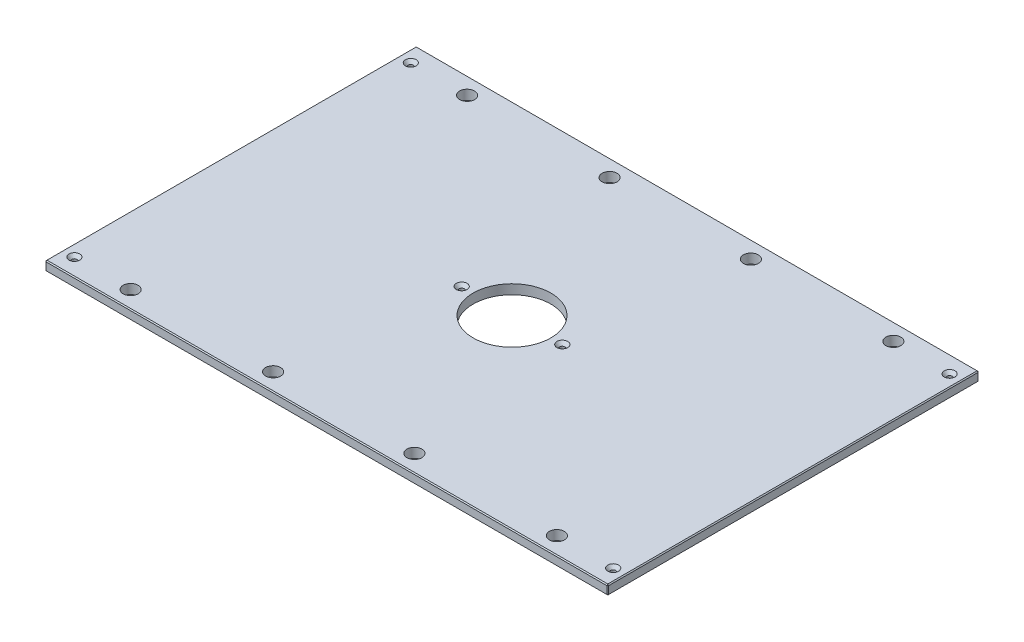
from build123d import *

# Parameters (mm, degrees)
SKETCH1_W                                        = 746.125
SKETCH1_H                                        = 492.125
BOSS_EXTRUDE1_DEPTH                              = 12.7
SKETCH13_R                                       = 51.562
CUT_EXTRUDE6_DEPTH                               = 448.083518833
F_25_32_0_78125_DIAMETER_HOLE1_D                 = 19.84375
CHAMFER2_SIZE                                    = 1.27
CSK_FOR_1_4_FLAT_HEAD_MACHINE_SCREW1_D           = 6.7564
CSK_FOR_1_4_FLAT_HEAD_MACHINE_SCREW1_CSINK_D     = 14.2748
CSK_FOR_1_4_FLAT_HEAD_MACHINE_SCREW1_CSINK_ANGLE = 82


with BuildPart() as part:
    # Sketch1 → Boss-Extrude1 (new body)
    with BuildSketch(Plane(origin=(0, 0, 0), x_dir=(1, 0, 0), z_dir=(0, 1, 0))):
        Rectangle(SKETCH1_W, SKETCH1_H)
    extrude(amount=BOSS_EXTRUDE1_DEPTH)

    # Sketch13 → Cut-Extrude6 (cut, through all)
    with BuildSketch(Plane(origin=(0, 12.7, 0), x_dir=(1, 0, 0), z_dir=(0, 1, 0))):
        with Locations(Location((0, 0, 0), (0, 0, 270))):
            Circle(SKETCH13_R)
    extrude(amount=-CUT_EXTRUDE6_DEPTH, mode=Mode.SUBTRACT)

    # 25_32 _0.78125_ Diameter Hole1 (through all)
    with Locations(Plane(origin=(0, 12.7, 0), x_dir=(1, 0, 0), z_dir=(0, 1, 0))):
        with Locations((282.575, 223.04248), (-282.575, 223.04248), (282.575, -223.04248), (-282.575, -223.04248), (-93.6625, 223.04248), (93.6625, 223.04248), (93.6625, -223.04248), (-93.6625, -223.04248)):
            Hole(F_25_32_0_78125_DIAMETER_HOLE1_D / 2)

    # Chamfer2
    chamfer2_edges = [part.edges().sort_by_distance(p)[0] for p in [
        (373.0625, 12.7, 0),
        (0, 12.7, -246.0625),
        (-373.0625, 12.7, 0),
        (0, 0, -246.0625),
        (373.0625, 0, 0),
        (0, 0, 246.0625),
        (-373.0625, 0, 0),
        (0, 12.7, 246.0625),
        (-373.0625, 6.35, -246.0625),
        (373.0625, 6.35, -246.0625),
        (373.0625, 6.35, 246.0625),
        (-373.0625, 6.35, 246.0625),
    ]]
    chamfer(chamfer2_edges, length=CHAMFER2_SIZE)

    # CSK for 1_4 Flat Head Machine Screw1 (through all)
    with Locations(Plane(origin=(0, 12.7, 0), x_dir=(1, 0, 0), z_dir=(0, 1, 0))):
        with Locations((357.1875, 223.04248), (357.1875, -223.04248), (-357.1875, -223.04248), (-66.675, 0), (66.675, 0), (-357.1875, 223.04248), (-282.575, 223.04248), (-282.575, -223.04248)):
            CounterSinkHole(CSK_FOR_1_4_FLAT_HEAD_MACHINE_SCREW1_D / 2, CSK_FOR_1_4_FLAT_HEAD_MACHINE_SCREW1_CSINK_D / 2, counter_sink_angle=CSK_FOR_1_4_FLAT_HEAD_MACHINE_SCREW1_CSINK_ANGLE)


solid = part.part
